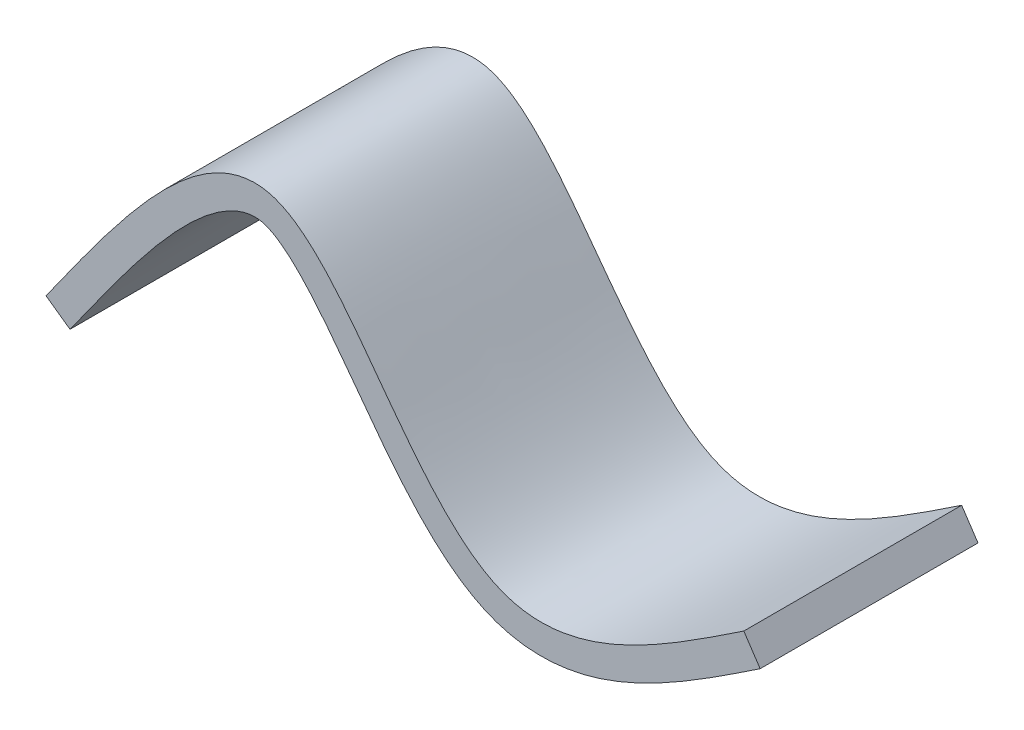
ISO-10303-21;
HEADER;
FILE_DESCRIPTION(('STEP AP214'),'2;1');
FILE_NAME('part.step','',(''),(''),'','','');
FILE_SCHEMA(('AUTOMOTIVE_DESIGN { 1 0 10303 214 1 1 1 1 }'));
ENDSEC;
DATA;
#1=APPLICATION_CONTEXT('core data for automotive mechanical design processes');
#2=APPLICATION_PROTOCOL_DEFINITION('international standard','automotive_design',2000,#1);
#3=PRODUCT_CONTEXT('',#1,'mechanical');
#4=PRODUCT('Part','Part','',(#3));
#5=PRODUCT_RELATED_PRODUCT_CATEGORY('part','',(#4));
#6=PRODUCT_DEFINITION_FORMATION('','',#4);
#7=PRODUCT_DEFINITION_CONTEXT('part definition',#1,'design');
#8=PRODUCT_DEFINITION('design','',#6,#7);
#9=PRODUCT_DEFINITION_SHAPE('','',#8);
#10=(LENGTH_UNIT() NAMED_UNIT(*) SI_UNIT(.MILLI.,.METRE.));
#11=(NAMED_UNIT(*) PLANE_ANGLE_UNIT() SI_UNIT($,.RADIAN.));
#12=(NAMED_UNIT(*) SI_UNIT($,.STERADIAN.) SOLID_ANGLE_UNIT());
#13=UNCERTAINTY_MEASURE_WITH_UNIT(LENGTH_MEASURE(1.E-05),#10,'distance_accuracy_value','');
#14=(GEOMETRIC_REPRESENTATION_CONTEXT(3) GLOBAL_UNCERTAINTY_ASSIGNED_CONTEXT((#13)) GLOBAL_UNIT_ASSIGNED_CONTEXT((#10,
#11,#12)) REPRESENTATION_CONTEXT('',''));
#15=CARTESIAN_POINT('',(0.,0.,0.));
#16=DIRECTION('',(0.,0.,1.));
#17=DIRECTION('',(1.,0.,0.));
#18=AXIS2_PLACEMENT_3D('',#15,#16,#17);
#19=CARTESIAN_POINT('',(-8.1111552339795,6.10642845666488,0.));
#20=DIRECTION('',(0.,0.,-1.));
#21=DIRECTION('',(-1.,0.,0.));
#22=AXIS2_PLACEMENT_3D('',#19,#20,#21);
#23=PLANE('',#22);
#24=DIRECTION('',(0.815720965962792,-0.578445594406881,0.));
#25=VECTOR('',#24,1.);
#26=CARTESIAN_POINT('',(-123.895256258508,-15.3748979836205,0.));
#27=LINE('',#26,#25);
#28=CARTESIAN_POINT('',(-123.895256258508,-15.3748979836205,0.));
#29=VERTEX_POINT('',#28);
#30=CARTESIAN_POINT('',(-115.738046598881,-21.1593539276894,0.));
#31=VERTEX_POINT('',#30);
#32=EDGE_CURVE('E11',#29,#31,#27,.T.);
#33=ORIENTED_EDGE('',*,*,#32,.F.);
#34=CARTESIAN_POINT('',(-123.895256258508,-15.3748979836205,0.));
#35=CARTESIAN_POINT('',(-97.4183903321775,21.9626405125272,0.));
#36=CARTESIAN_POINT('',(-42.5872049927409,99.2852926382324,0.));
#37=CARTESIAN_POINT('',(18.1572526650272,-58.8106771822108,0.));
#38=CARTESIAN_POINT('',(83.9371180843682,-14.948107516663,0.));
#39=CARTESIAN_POINT('',(113.139549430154,4.52432027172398,0.));
#40=B_SPLINE_CURVE_WITH_KNOTS('',3,(#34,#35,#36,#37,#38,#39),.UNSPECIFIED.,.F.,.F.,(4,1,1,4),
(0.,0.341775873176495,0.707786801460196,1.),.UNSPECIFIED.);
#41=CARTESIAN_POINT('',(113.139549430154,4.52432027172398,0.));
#42=VERTEX_POINT('',#41);
#43=EDGE_CURVE('E94',#29,#42,#40,.T.);
#44=ORIENTED_EDGE('',*,*,#43,.T.);
#45=DIRECTION('',(0.554781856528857,-0.83199584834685,0.));
#46=VECTOR('',#45,1.);
#47=CARTESIAN_POINT('',(113.139549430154,4.52432027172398,0.));
#48=LINE('',#47,#46);
#49=CARTESIAN_POINT('',(118.687367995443,-3.79563821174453,0.));
#50=VERTEX_POINT('',#49);
#51=EDGE_CURVE('E44',#42,#50,#48,.T.);
#52=ORIENTED_EDGE('',*,*,#51,.T.);
#53=CARTESIAN_POINT('',(-115.738046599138,-21.1593539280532,0.));
#54=CARTESIAN_POINT('',(-114.530320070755,-19.4562853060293,0.));
#55=CARTESIAN_POINT('',(-113.322640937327,-17.7531719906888,0.));
#56=CARTESIAN_POINT('',(-110.911941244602,-14.3612367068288,0.));
#57=CARTESIAN_POINT('',(-109.708945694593,-12.6723969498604,0.));
#58=CARTESIAN_POINT('',(-107.308320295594,-9.31757341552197,0.));
#59=CARTESIAN_POINT('',(-106.110766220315,-7.65153551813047,0.));
#60=CARTESIAN_POINT('',(-103.721801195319,-4.35103558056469,0.));
#61=CARTESIAN_POINT('',(-102.530545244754,-2.71646153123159,0.));
#62=CARTESIAN_POINT('',(-100.15509206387,0.512275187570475,0.));
#63=CARTESIAN_POINT('',(-98.9711598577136,2.10663248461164,0.));
#64=CARTESIAN_POINT('',(-96.6114222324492,5.2459608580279,0.));
#65=CARTESIAN_POINT('',(-95.4360265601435,6.79123930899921,0.));
#66=CARTESIAN_POINT('',(-93.0946261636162,9.82328592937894,0.));
#67=CARTESIAN_POINT('',(-91.9292153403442,11.3105116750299,0.));
#68=CARTESIAN_POINT('',(-89.6093010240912,14.2171640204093,0.));
#69=CARTESIAN_POINT('',(-88.4556209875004,15.6372461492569,0.));
#70=CARTESIAN_POINT('',(-86.1610155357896,18.4001471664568,0.));
#71=CARTESIAN_POINT('',(-85.0211957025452,19.7438814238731,0.));
#72=CARTESIAN_POINT('',(-82.7566003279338,22.3444378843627,0.));
#73=CARTESIAN_POINT('',(-81.6332731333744,23.6025169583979,0.));
#74=CARTESIAN_POINT('',(-79.4045340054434,26.0219645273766,0.));
#75=CARTESIAN_POINT('',(-78.3009827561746,27.1850390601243,0.));
#76=CARTESIAN_POINT('',(-76.115474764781,29.4045210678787,0.));
#77=CARTESIAN_POINT('',(-75.0358662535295,30.463231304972,0.));
#78=CARTESIAN_POINT('',(-72.9028719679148,32.4642374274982,0.));
#79=CARTESIAN_POINT('',(-71.8524057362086,33.4096152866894,0.));
#80=CARTESIAN_POINT('',(-70.2702133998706,34.759152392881,0.));
#81=CARTESIAN_POINT('',(-69.757416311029,35.1855415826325,0.));
#82=CARTESIAN_POINT('',(-68.7412308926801,36.0061294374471,0.));
#83=CARTESIAN_POINT('',(-68.2383302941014,36.4009301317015,0.));
#84=CARTESIAN_POINT('',(-67.2430121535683,37.157377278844,0.));
#85=CARTESIAN_POINT('',(-66.7511230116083,37.5197173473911,0.));
#86=CARTESIAN_POINT('',(-65.7789827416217,38.2103920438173,0.));
#87=CARTESIAN_POINT('',(-65.2992999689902,38.5395242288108,0.));
#88=CARTESIAN_POINT('',(-64.3528324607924,39.1631021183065,0.));
#89=CARTESIAN_POINT('',(-63.8866515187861,39.4584611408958,0.));
#90=CARTESIAN_POINT('',(-62.9685227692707,40.0140302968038,0.));
#91=CARTESIAN_POINT('',(-62.5172067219,40.2752804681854,0.));
#92=CARTESIAN_POINT('',(-61.6301711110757,40.762452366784,0.));
#93=CARTESIAN_POINT('',(-61.1950998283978,40.9895487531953,0.));
#94=CARTESIAN_POINT('',(-60.3418933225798,41.4085711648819,0.));
#95=CARTESIAN_POINT('',(-59.9244052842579,41.6018093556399,0.));
#96=CARTESIAN_POINT('',(-59.1075088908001,41.9537037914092,0.));
#97=CARTESIAN_POINT('',(-58.7087276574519,42.1138011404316,0.));
#98=CARTESIAN_POINT('',(-58.1145600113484,42.3325253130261,0.));
#99=CARTESIAN_POINT('',(-57.9224960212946,42.4002383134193,0.));
#100=CARTESIAN_POINT('',(-57.5432715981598,42.527632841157,0.));
#101=CARTESIAN_POINT('',(-57.3561784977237,42.5875139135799,0.));
#102=CARTESIAN_POINT('',(-56.9869320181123,42.6994483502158,0.));
#103=CARTESIAN_POINT('',(-56.8048402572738,42.7517046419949,0.));
#104=CARTESIAN_POINT('',(-56.4455810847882,42.8486168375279,0.));
#105=CARTESIAN_POINT('',(-56.2684689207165,42.8934769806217,0.));
#106=CARTESIAN_POINT('',(-55.9191042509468,42.9758437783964,0.));
#107=CARTESIAN_POINT('',(-55.7468997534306,43.0135534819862,0.));
#108=CARTESIAN_POINT('',(-55.4072275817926,43.0818802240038,0.));
#109=CARTESIAN_POINT('',(-55.2398000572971,43.1126961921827,0.));
#110=CARTESIAN_POINT('',(-54.9094957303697,43.1675029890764,0.));
#111=CARTESIAN_POINT('',(-54.7466508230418,43.1916852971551,0.));
#112=CARTESIAN_POINT('',(-54.4252577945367,43.2334902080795,0.));
#113=CARTESIAN_POINT('',(-54.2667332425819,43.2512931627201,0.));
#114=CARTESIAN_POINT('',(-53.9536565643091,43.2805925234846,0.));
#115=CARTESIAN_POINT('',(-53.799120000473,43.2922542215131,0.));
#116=CARTESIAN_POINT('',(-53.4936241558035,43.3095006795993,0.));
#117=CARTESIAN_POINT('',(-53.3426732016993,43.3152316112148,0.));
#118=CARTESIAN_POINT('',(-53.043884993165,43.3208107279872,0.));
#119=CARTESIAN_POINT('',(-52.8960500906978,43.3207819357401,0.));
#120=CARTESIAN_POINT('',(-52.6029672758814,43.3149884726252,0.));
#121=CARTESIAN_POINT('',(-52.4577174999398,43.3093198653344,0.));
#122=CARTESIAN_POINT('',(-52.1692234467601,43.292335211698,0.));
#123=CARTESIAN_POINT('',(-52.0259753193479,43.2810848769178,0.));
#124=CARTESIAN_POINT('',(-51.740859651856,43.2529567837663,0.));
#125=CARTESIAN_POINT('',(-51.5989889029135,43.2361116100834,0.));
#126=CARTESIAN_POINT('',(-51.3159731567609,43.1967389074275,0.));
#127=CARTESIAN_POINT('',(-51.1748285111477,43.1742088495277,0.));
#128=CARTESIAN_POINT('',(-50.8925970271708,43.1233279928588,0.));
#129=CARTESIAN_POINT('',(-50.7515171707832,43.0949384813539,0.));
#130=CARTESIAN_POINT('',(-50.4687466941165,43.0321295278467,0.));
#131=CARTESIAN_POINT('',(-50.3270727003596,42.9976352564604,0.));
#132=CARTESIAN_POINT('',(-50.0419559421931,42.9221468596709,0.));
#133=CARTESIAN_POINT('',(-49.8985481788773,42.8810207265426,0.));
#134=CARTESIAN_POINT('',(-49.6064083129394,42.7911140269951,0.));
#135=CARTESIAN_POINT('',(-49.4577618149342,42.7420562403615,0.));
#136=CARTESIAN_POINT('',(-49.15443910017,42.6357586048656,0.));
#137=CARTESIAN_POINT('',(-48.9998676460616,42.5782208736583,0.));
#138=CARTESIAN_POINT('',(-48.684634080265,42.4545418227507,0.));
#139=CARTESIAN_POINT('',(-48.5240882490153,42.3881049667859,0.));
#140=CARTESIAN_POINT('',(-48.1969392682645,42.2462660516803,0.));
#141=CARTESIAN_POINT('',(-48.0304611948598,42.1705763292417,0.));
#142=CARTESIAN_POINT('',(-47.6915595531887,42.0099217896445,0.));
#143=CARTESIAN_POINT('',(-47.5192672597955,41.9246806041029,0.));
#144=CARTESIAN_POINT('',(-47.1689181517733,41.7446719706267,0.));
#145=CARTESIAN_POINT('',(-46.9909967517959,41.6496419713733,0.));
#146=CARTESIAN_POINT('',(-46.43635503,41.3430613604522,0.));
#147=CARTESIAN_POINT('',(-46.0646587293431,41.1223855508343,0.));
#148=CARTESIAN_POINT('',(-45.3007068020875,40.6423061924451,0.));
#149=CARTESIAN_POINT('',(-44.909530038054,40.3812035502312,0.));
#150=CARTESIAN_POINT('',(-44.1088617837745,39.8200914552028,0.));
#151=CARTESIAN_POINT('',(-43.700386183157,39.5186391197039,0.));
#152=CARTESIAN_POINT('',(-42.8673758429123,38.8773495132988,0.));
#153=CARTESIAN_POINT('',(-42.4437730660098,38.5363079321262,0.));
#154=CARTESIAN_POINT('',(-41.5825836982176,37.8168573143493,0.));
#155=CARTESIAN_POINT('',(-41.1458321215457,37.4374528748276,0.));
#156=CARTESIAN_POINT('',(-40.2601830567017,36.642675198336,0.));
#157=CARTESIAN_POINT('',(-39.8120203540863,36.2264860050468,0.));
#158=CARTESIAN_POINT('',(-38.9051627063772,35.3597796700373,0.));
#159=CARTESIAN_POINT('',(-38.4471065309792,34.9085967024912,0.));
#160=CARTESIAN_POINT('',(-37.0290986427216,33.4761951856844,0.));
#161=CARTESIAN_POINT('',(-36.0896514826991,32.4746817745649,0.));
#162=CARTESIAN_POINT('',(-34.1801352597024,30.3595280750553,0.));
#163=CARTESIAN_POINT('',(-33.2131445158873,29.2431435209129,0.));
#164=CARTESIAN_POINT('',(-31.2542530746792,26.9139291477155,0.));
#165=CARTESIAN_POINT('',(-30.2644233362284,25.6993669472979,0.));
#166=CARTESIAN_POINT('',(-28.2633561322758,23.1899119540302,0.));
#167=CARTESIAN_POINT('',(-27.2534217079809,21.8939866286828,0.));
#168=CARTESIAN_POINT('',(-25.2139591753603,19.2377680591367,0.));
#169=CARTESIAN_POINT('',(-24.1851662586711,17.8769130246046,0.));
#170=CARTESIAN_POINT('',(-22.108526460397,15.1065719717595,0.));
#171=CARTESIAN_POINT('',(-21.061013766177,13.6968363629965,0.));
#172=CARTESIAN_POINT('',(-18.9464717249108,10.8442138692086,0.));
#173=CARTESIAN_POINT('',(-17.8795146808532,9.40127419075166,0.));
#174=CARTESIAN_POINT('',(-14.6296327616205,5.02144628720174,0.));
#175=CARTESIAN_POINT('',(-12.4390424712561,2.09006011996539,0.));
#176=CARTESIAN_POINT('',(-9.07929276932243,-2.26914300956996,0.));
#177=CARTESIAN_POINT('',(-7.94235575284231,-3.72164550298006,0.));
#178=CARTESIAN_POINT('',(-5.63880670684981,-6.60082662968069,0.));
#179=CARTESIAN_POINT('',(-4.47222304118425,-8.02752786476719,0.));
#180=CARTESIAN_POINT('',(-2.10457596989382,-10.8408911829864,0.));
#181=CARTESIAN_POINT('',(-0.903698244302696,-12.2277086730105,0.));
#182=CARTESIAN_POINT('',(1.53851719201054,-14.946996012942,0.));
#183=CARTESIAN_POINT('',(2.77949049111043,-16.2797916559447,0.));
#184=CARTESIAN_POINT('',(5.30946727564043,-18.8765718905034,0.));
#185=CARTESIAN_POINT('',(6.59794582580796,-20.1410627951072,0.));
#186=CARTESIAN_POINT('',(8.5775540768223,-21.978261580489,0.));
#187=CARTESIAN_POINT('',(9.24291241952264,-22.5788084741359,0.));
#188=CARTESIAN_POINT('',(10.5890595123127,-23.7567046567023,0.));
#189=CARTESIAN_POINT('',(11.2697730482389,-24.3341396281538,0.));
#190=CARTESIAN_POINT('',(12.647982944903,-25.4635791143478,0.));
#191=CARTESIAN_POINT('',(13.3454111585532,-26.0156666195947,0.));
#192=CARTESIAN_POINT('',(14.7585034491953,-27.0919898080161,0.));
#193=CARTESIAN_POINT('',(15.4741129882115,-27.6162969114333,0.));
#194=CARTESIAN_POINT('',(16.9250491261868,-28.6343862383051,0.));
#195=CARTESIAN_POINT('',(17.6603418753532,-29.1282165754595,0.));
#196=CARTESIAN_POINT('',(19.1520963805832,-30.0823810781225,0.));
#197=CARTESIAN_POINT('',(19.9085516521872,-30.5427253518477,0.));
#198=CARTESIAN_POINT('',(21.4439693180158,-31.426569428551,0.));
#199=CARTESIAN_POINT('',(22.2229577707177,-31.8500240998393,0.));
#200=CARTESIAN_POINT('',(23.8044980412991,-32.656427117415,0.));
#201=CARTESIAN_POINT('',(24.6071106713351,-33.0392566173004,0.));
#202=CARTESIAN_POINT('',(26.235622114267,-33.7595952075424,0.));
#203=CARTESIAN_POINT('',(27.0615882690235,-34.0969525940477,0.));
#204=CARTESIAN_POINT('',(28.7264819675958,-34.7194251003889,0.));
#205=CARTESIAN_POINT('',(29.5652803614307,-35.0048853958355,0.));
#206=CARTESIAN_POINT('',(31.2509853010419,-35.5234261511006,0.));
#207=CARTESIAN_POINT('',(32.097759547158,-35.7569370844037,0.));
#208=CARTESIAN_POINT('',(33.7969808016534,-36.1726583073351,0.));
#209=CARTESIAN_POINT('',(34.6493358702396,-36.3552447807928,0.));
#210=CARTESIAN_POINT('',(36.3574002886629,-36.6706920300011,0.));
#211=CARTESIAN_POINT('',(37.2130510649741,-36.8038707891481,0.));
#212=CARTESIAN_POINT('',(38.9256556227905,-37.0223915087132,0.));
#213=CARTESIAN_POINT('',(39.7825766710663,-37.1079911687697,0.));
#214=CARTESIAN_POINT('',(41.4959881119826,-37.2335058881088,0.));
#215=CARTESIAN_POINT('',(42.3524642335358,-37.2736176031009,0.));
#216=CARTESIAN_POINT('',(44.0636032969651,-37.3104730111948,0.));
#217=CARTESIAN_POINT('',(44.9182633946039,-37.3073536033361,0.));
#218=CARTESIAN_POINT('',(46.624736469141,-37.2601431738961,0.));
#219=CARTESIAN_POINT('',(47.4765517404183,-37.216132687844,0.));
#220=CARTESIAN_POINT('',(49.1766241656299,-37.0895410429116,0.));
#221=CARTESIAN_POINT('',(50.0248835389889,-37.0069893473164,0.));
#222=CARTESIAN_POINT('',(51.7174143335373,-36.8056628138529,0.));
#223=CARTESIAN_POINT('',(52.5616839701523,-36.6868730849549,0.));
#224=CARTESIAN_POINT('',(54.2460368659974,-36.4153241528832,0.));
#225=CARTESIAN_POINT('',(55.0861117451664,-36.2625132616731,0.));
#226=CARTESIAN_POINT('',(56.7620578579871,-35.9250575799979,0.));
#227=CARTESIAN_POINT('',(57.5979127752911,-35.7403321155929,0.));
#228=CARTESIAN_POINT('',(59.2655326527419,-35.3410542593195,0.));
#229=CARTESIAN_POINT('',(60.0972730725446,-35.1263997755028,0.));
#230=CARTESIAN_POINT('',(61.7568761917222,-34.6691407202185,0.));
#231=CARTESIAN_POINT('',(62.5847066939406,-34.4264195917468,0.));
#232=CARTESIAN_POINT('',(64.2367307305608,-33.9147836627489,0.));
#233=CARTESIAN_POINT('',(65.0608853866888,-33.6457439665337,0.));
#234=CARTESIAN_POINT('',(67.5355244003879,-32.7993673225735,0.));
#235=CARTESIAN_POINT('',(69.1740138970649,-32.186745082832,0.));
#236=CARTESIAN_POINT('',(72.4399405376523,-30.8759811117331,0.));
#237=CARTESIAN_POINT('',(74.0669807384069,-30.1768623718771,0.));
#238=CARTESIAN_POINT('',(77.3122915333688,-28.7038022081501,0.));
#239=CARTESIAN_POINT('',(78.9301713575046,-27.9290042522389,0.));
#240=CARTESIAN_POINT('',(82.1587664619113,-26.3145282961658,0.));
#241=CARTESIAN_POINT('',(83.7691306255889,-25.4741520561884,0.));
#242=CARTESIAN_POINT('',(86.9837673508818,-23.7378395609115,0.));
#243=CARTESIAN_POINT('',(88.5877506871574,-22.8413703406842,0.));
#244=CARTESIAN_POINT('',(93.4124256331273,-20.0705308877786,0.));
#245=CARTESIAN_POINT('',(96.5998309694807,-18.1383548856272,0.));
#246=CARTESIAN_POINT('',(102.952126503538,-14.1608451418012,0.));
#247=CARTESIAN_POINT('',(106.116362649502,-12.1144848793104,0.));
#248=CARTESIAN_POINT('',(110.843429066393,-9.01016038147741,0.));
#249=CARTESIAN_POINT('',(112.417187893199,-7.96871848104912,0.));
#250=CARTESIAN_POINT('',(115.556416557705,-5.88338570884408,0.));
#251=CARTESIAN_POINT('',(117.121897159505,-4.83951106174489,0.));
#252=CARTESIAN_POINT('',(118.687367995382,-3.79563821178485,0.));
#253=B_SPLINE_CURVE_WITH_KNOTS('',3,(#53,#54,#55,#56,#57,#58,#59,#60,#61,#62,#63,#64,#65,#66,
#67,#68,#69,#70,#71,#72,#73,#74,#75,#76,#77,#78,#79,#80,#81,#82,#83,#84,#85,#86,#87,#88,#89,#90,
#91,#92,#93,#94,#95,#96,#97,#98,#99,#100,#101,#102,#103,#104,#105,#106,#107,#108,#109,#110,#111,
#112,#113,#114,#115,#116,#117,#118,#119,#120,#121,#122,#123,#124,#125,#126,#127,#128,#129,#130,
#131,#132,#133,#134,#135,#136,#137,#138,#139,#140,#141,#142,#143,#144,#145,#146,#147,#148,#149,
#150,#151,#152,#153,#154,#155,#156,#157,#158,#159,#160,#161,#162,#163,#164,#165,#166,#167,#168,
#169,#170,#171,#172,#173,#174,#175,#176,#177,#178,#179,#180,#181,#182,#183,#184,#185,#186,#187,
#188,#189,#190,#191,#192,#193,#194,#195,#196,#197,#198,#199,#200,#201,#202,#203,#204,#205,#206,
#207,#208,#209,#210,#211,#212,#213,#214,#215,#216,#217,#218,#219,#220,#221,#222,#223,#224,#225,
#226,#227,#228,#229,#230,#231,#232,#233,#234,#235,#236,#237,#238,#239,#240,#241,#242,#243,#244,
#245,#246,#247,#248,#249,#250,#251,#252),.UNSPECIFIED.,.F.,.F.,(4,2,2,2,2,2,2,2,2,2,2,2,2,2,2,2,
2,2,2,2,2,2,2,2,2,2,2,2,2,2,2,2,2,2,2,2,2,2,2,2,2,2,2,2,2,2,2,2,2,2,2,2,2,2,2,2,2,2,2,2,2,2,2,2,
2,2,2,2,2,2,2,2,2,2,2,2,2,2,2,2,2,2,2,2,2,2,2,2,2,2,2,2,2,2,2,2,2,2,2,4),(0.,6.26351388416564,
12.4839895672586,18.639312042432,24.7070619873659,30.664562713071,36.4889159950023,
42.1570287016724,47.6456325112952,52.9313005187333,57.9904683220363,62.7994755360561,
67.3346611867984,71.572581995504,73.573091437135,75.4908803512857,77.3233821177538,
79.0682507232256,80.7234594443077,82.2874360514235,83.7592443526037,85.1388217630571,
86.4272799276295,87.0381587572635,87.6273962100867,88.1956316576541,88.7436535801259,
89.2724125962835,89.7830332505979,90.2768238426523,90.7552834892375,91.2201056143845,
91.6731770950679,92.1165724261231,92.5525424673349,92.9834976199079,93.4119856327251,
93.840664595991,94.2722720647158,94.7095915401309,95.1570369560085,95.6265182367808,
96.1212063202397,96.6423464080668,97.1908743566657,97.7674509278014,98.3724963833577,
99.6685436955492,101.078921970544,102.601411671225,104.23246989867,105.967708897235,
107.802228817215,109.730841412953,113.848703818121,118.278764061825,122.978690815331,
127.90738039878,133.025193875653,138.294102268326,143.677862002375,154.655458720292,
160.188817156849,165.71706739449,171.219596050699,176.681477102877,182.094812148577,
184.783372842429,187.460812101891,190.128747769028,192.789453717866,195.445845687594,
198.101432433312,200.760223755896,203.426590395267,206.101643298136,208.75819529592,
211.391838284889,214.005477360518,216.601990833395,219.184300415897,221.755402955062,
224.318365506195,226.876290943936,229.432264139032,231.989289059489,234.550225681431,
237.117733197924,239.694223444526,242.281826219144,244.882366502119,250.127527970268,
255.438533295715,260.818768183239,266.267240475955,271.779149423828,282.957951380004,
294.262200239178,299.923632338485,305.568404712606),.UNSPECIFIED.);
#254=EDGE_CURVE('E108',#31,#50,#253,.T.);
#255=ORIENTED_EDGE('',*,*,#254,.F.);
#256=EDGE_LOOP('',(#33,#44,#52,#255));
#257=FACE_BOUND('',#256,.T.);
#258=ADVANCED_FACE('F34',(#257),#23,.T.);
#259=CARTESIAN_POINT('',(113.139549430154,4.52432027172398,0.));
#260=DIRECTION('',(0.83199584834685,0.554781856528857,0.));
#261=DIRECTION('',(0.,0.,1.));
#262=AXIS2_PLACEMENT_3D('',#259,#260,#261);
#263=PLANE('',#262);
#264=ORIENTED_EDGE('',*,*,#51,.F.);
#265=DIRECTION('',(0.,0.,1.));
#266=VECTOR('',#265,1.);
#267=CARTESIAN_POINT('',(113.139549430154,4.52432027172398,0.));
#268=LINE('',#267,#266);
#269=CARTESIAN_POINT('',(113.139549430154,4.52432027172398,74.));
#270=VERTEX_POINT('',#269);
#271=EDGE_CURVE('E90',#42,#270,#268,.T.);
#272=ORIENTED_EDGE('',*,*,#271,.T.);
#273=DIRECTION('',(0.554781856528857,-0.83199584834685,0.));
#274=VECTOR('',#273,1.);
#275=CARTESIAN_POINT('',(113.139549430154,4.52432027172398,74.));
#276=LINE('',#275,#274);
#277=CARTESIAN_POINT('',(118.687367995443,-3.79563821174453,74.));
#278=VERTEX_POINT('',#277);
#279=EDGE_CURVE('E75',#270,#278,#276,.T.);
#280=ORIENTED_EDGE('',*,*,#279,.T.);
#281=DIRECTION('',(0.,0.,1.));
#282=VECTOR('',#281,1.);
#283=CARTESIAN_POINT('',(118.687367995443,-3.79563821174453,0.));
#284=LINE('',#283,#282);
#285=EDGE_CURVE('E112',#50,#278,#284,.T.);
#286=ORIENTED_EDGE('',*,*,#285,.F.);
#287=EDGE_LOOP('',(#264,#272,#280,#286));
#288=FACE_BOUND('',#287,.T.);
#289=ADVANCED_FACE('F93',(#288),#263,.T.);
#290=CARTESIAN_POINT('',(-8.1111552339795,6.10642845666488,74.));
#291=DIRECTION('',(0.,0.,-1.));
#292=DIRECTION('',(-1.,0.,0.));
#293=AXIS2_PLACEMENT_3D('',#290,#291,#292);
#294=PLANE('',#293);
#295=ORIENTED_EDGE('',*,*,#279,.F.);
#296=CARTESIAN_POINT('',(-123.895256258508,-15.3748979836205,74.));
#297=CARTESIAN_POINT('',(-97.4183903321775,21.9626405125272,74.));
#298=CARTESIAN_POINT('',(-42.5872049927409,99.2852926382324,74.));
#299=CARTESIAN_POINT('',(18.1572526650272,-58.8106771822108,74.));
#300=CARTESIAN_POINT('',(83.9371180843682,-14.948107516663,74.));
#301=CARTESIAN_POINT('',(113.139549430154,4.52432027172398,74.));
#302=B_SPLINE_CURVE_WITH_KNOTS('',3,(#296,#297,#298,#299,#300,#301),.UNSPECIFIED.,.F.,.F.,(4,1,
1,4),(0.,0.341775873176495,0.707786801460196,1.),.UNSPECIFIED.);
#303=CARTESIAN_POINT('',(-123.895256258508,-15.3748979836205,74.));
#304=VERTEX_POINT('',#303);
#305=EDGE_CURVE('E78',#304,#270,#302,.T.);
#306=ORIENTED_EDGE('',*,*,#305,.F.);
#307=DIRECTION('',(0.815720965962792,-0.578445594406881,0.));
#308=VECTOR('',#307,1.);
#309=CARTESIAN_POINT('',(-123.895256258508,-15.3748979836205,74.));
#310=LINE('',#309,#308);
#311=CARTESIAN_POINT('',(-115.738046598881,-21.1593539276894,74.));
#312=VERTEX_POINT('',#311);
#313=EDGE_CURVE('E38',#304,#312,#310,.T.);
#314=ORIENTED_EDGE('',*,*,#313,.T.);
#315=CARTESIAN_POINT('',(-115.738046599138,-21.1593539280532,74.));
#316=CARTESIAN_POINT('',(-114.530320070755,-19.4562853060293,74.));
#317=CARTESIAN_POINT('',(-113.322640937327,-17.7531719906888,74.));
#318=CARTESIAN_POINT('',(-110.911941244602,-14.3612367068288,74.));
#319=CARTESIAN_POINT('',(-109.708945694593,-12.6723969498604,74.));
#320=CARTESIAN_POINT('',(-107.308320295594,-9.31757341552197,74.));
#321=CARTESIAN_POINT('',(-106.110766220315,-7.65153551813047,74.));
#322=CARTESIAN_POINT('',(-103.721801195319,-4.35103558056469,74.));
#323=CARTESIAN_POINT('',(-102.530545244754,-2.71646153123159,74.));
#324=CARTESIAN_POINT('',(-100.15509206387,0.512275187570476,74.));
#325=CARTESIAN_POINT('',(-98.9711598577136,2.10663248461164,74.));
#326=CARTESIAN_POINT('',(-96.6114222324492,5.2459608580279,74.));
#327=CARTESIAN_POINT('',(-95.4360265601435,6.79123930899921,74.));
#328=CARTESIAN_POINT('',(-93.0946261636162,9.82328592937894,74.));
#329=CARTESIAN_POINT('',(-91.9292153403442,11.3105116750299,74.));
#330=CARTESIAN_POINT('',(-89.6093010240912,14.2171640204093,74.));
#331=CARTESIAN_POINT('',(-88.4556209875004,15.6372461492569,74.));
#332=CARTESIAN_POINT('',(-86.1610155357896,18.4001471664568,74.));
#333=CARTESIAN_POINT('',(-85.0211957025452,19.7438814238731,74.));
#334=CARTESIAN_POINT('',(-82.7566003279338,22.3444378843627,74.));
#335=CARTESIAN_POINT('',(-81.6332731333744,23.6025169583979,74.));
#336=CARTESIAN_POINT('',(-79.4045340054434,26.0219645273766,74.));
#337=CARTESIAN_POINT('',(-78.3009827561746,27.1850390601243,74.));
#338=CARTESIAN_POINT('',(-76.115474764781,29.4045210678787,74.));
#339=CARTESIAN_POINT('',(-75.0358662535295,30.463231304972,74.));
#340=CARTESIAN_POINT('',(-72.9028719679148,32.4642374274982,74.));
#341=CARTESIAN_POINT('',(-71.8524057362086,33.4096152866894,74.));
#342=CARTESIAN_POINT('',(-70.2702133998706,34.759152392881,74.));
#343=CARTESIAN_POINT('',(-69.757416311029,35.1855415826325,74.));
#344=CARTESIAN_POINT('',(-68.7412308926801,36.0061294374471,74.));
#345=CARTESIAN_POINT('',(-68.2383302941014,36.4009301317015,74.));
#346=CARTESIAN_POINT('',(-67.2430121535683,37.157377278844,74.));
#347=CARTESIAN_POINT('',(-66.7511230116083,37.5197173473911,74.));
#348=CARTESIAN_POINT('',(-65.7789827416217,38.2103920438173,74.));
#349=CARTESIAN_POINT('',(-65.2992999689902,38.5395242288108,74.));
#350=CARTESIAN_POINT('',(-64.3528324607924,39.1631021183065,74.));
#351=CARTESIAN_POINT('',(-63.8866515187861,39.4584611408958,74.));
#352=CARTESIAN_POINT('',(-62.9685227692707,40.0140302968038,74.));
#353=CARTESIAN_POINT('',(-62.5172067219,40.2752804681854,74.));
#354=CARTESIAN_POINT('',(-61.6301711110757,40.762452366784,74.));
#355=CARTESIAN_POINT('',(-61.1950998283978,40.9895487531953,74.));
#356=CARTESIAN_POINT('',(-60.3418933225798,41.4085711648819,74.));
#357=CARTESIAN_POINT('',(-59.9244052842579,41.6018093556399,74.));
#358=CARTESIAN_POINT('',(-59.1075088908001,41.9537037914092,74.));
#359=CARTESIAN_POINT('',(-58.7087276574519,42.1138011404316,74.));
#360=CARTESIAN_POINT('',(-58.1145600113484,42.3325253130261,74.));
#361=CARTESIAN_POINT('',(-57.9224960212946,42.4002383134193,74.));
#362=CARTESIAN_POINT('',(-57.5432715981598,42.527632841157,74.));
#363=CARTESIAN_POINT('',(-57.3561784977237,42.5875139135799,74.));
#364=CARTESIAN_POINT('',(-56.9869320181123,42.6994483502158,74.));
#365=CARTESIAN_POINT('',(-56.8048402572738,42.7517046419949,74.));
#366=CARTESIAN_POINT('',(-56.4455810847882,42.8486168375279,74.));
#367=CARTESIAN_POINT('',(-56.2684689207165,42.8934769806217,74.));
#368=CARTESIAN_POINT('',(-55.9191042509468,42.9758437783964,74.));
#369=CARTESIAN_POINT('',(-55.7468997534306,43.0135534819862,74.));
#370=CARTESIAN_POINT('',(-55.4072275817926,43.0818802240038,74.));
#371=CARTESIAN_POINT('',(-55.2398000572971,43.1126961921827,74.));
#372=CARTESIAN_POINT('',(-54.9094957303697,43.1675029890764,74.));
#373=CARTESIAN_POINT('',(-54.7466508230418,43.1916852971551,74.));
#374=CARTESIAN_POINT('',(-54.4252577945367,43.2334902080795,74.));
#375=CARTESIAN_POINT('',(-54.2667332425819,43.2512931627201,74.));
#376=CARTESIAN_POINT('',(-53.9536565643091,43.2805925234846,74.));
#377=CARTESIAN_POINT('',(-53.799120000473,43.2922542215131,74.));
#378=CARTESIAN_POINT('',(-53.4936241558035,43.3095006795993,74.));
#379=CARTESIAN_POINT('',(-53.3426732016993,43.3152316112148,74.));
#380=CARTESIAN_POINT('',(-53.043884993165,43.3208107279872,74.));
#381=CARTESIAN_POINT('',(-52.8960500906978,43.3207819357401,74.));
#382=CARTESIAN_POINT('',(-52.6029672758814,43.3149884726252,74.));
#383=CARTESIAN_POINT('',(-52.4577174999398,43.3093198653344,74.));
#384=CARTESIAN_POINT('',(-52.1692234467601,43.292335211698,74.));
#385=CARTESIAN_POINT('',(-52.0259753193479,43.2810848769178,74.));
#386=CARTESIAN_POINT('',(-51.740859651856,43.2529567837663,74.));
#387=CARTESIAN_POINT('',(-51.5989889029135,43.2361116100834,74.));
#388=CARTESIAN_POINT('',(-51.3159731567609,43.1967389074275,74.));
#389=CARTESIAN_POINT('',(-51.1748285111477,43.1742088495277,74.));
#390=CARTESIAN_POINT('',(-50.8925970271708,43.1233279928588,74.));
#391=CARTESIAN_POINT('',(-50.7515171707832,43.0949384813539,74.));
#392=CARTESIAN_POINT('',(-50.4687466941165,43.0321295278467,74.));
#393=CARTESIAN_POINT('',(-50.3270727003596,42.9976352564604,74.));
#394=CARTESIAN_POINT('',(-50.0419559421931,42.9221468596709,74.));
#395=CARTESIAN_POINT('',(-49.8985481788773,42.8810207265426,74.));
#396=CARTESIAN_POINT('',(-49.6064083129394,42.7911140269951,74.));
#397=CARTESIAN_POINT('',(-49.4577618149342,42.7420562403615,74.));
#398=CARTESIAN_POINT('',(-49.15443910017,42.6357586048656,74.));
#399=CARTESIAN_POINT('',(-48.9998676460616,42.5782208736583,74.));
#400=CARTESIAN_POINT('',(-48.684634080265,42.4545418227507,74.));
#401=CARTESIAN_POINT('',(-48.5240882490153,42.3881049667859,74.));
#402=CARTESIAN_POINT('',(-48.1969392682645,42.2462660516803,74.));
#403=CARTESIAN_POINT('',(-48.0304611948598,42.1705763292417,74.));
#404=CARTESIAN_POINT('',(-47.6915595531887,42.0099217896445,74.));
#405=CARTESIAN_POINT('',(-47.5192672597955,41.9246806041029,74.));
#406=CARTESIAN_POINT('',(-47.1689181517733,41.7446719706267,74.));
#407=CARTESIAN_POINT('',(-46.9909967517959,41.6496419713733,74.));
#408=CARTESIAN_POINT('',(-46.43635503,41.3430613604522,74.));
#409=CARTESIAN_POINT('',(-46.0646587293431,41.1223855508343,74.));
#410=CARTESIAN_POINT('',(-45.3007068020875,40.6423061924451,74.));
#411=CARTESIAN_POINT('',(-44.909530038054,40.3812035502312,74.));
#412=CARTESIAN_POINT('',(-44.1088617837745,39.8200914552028,74.));
#413=CARTESIAN_POINT('',(-43.700386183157,39.5186391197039,74.));
#414=CARTESIAN_POINT('',(-42.8673758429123,38.8773495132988,74.));
#415=CARTESIAN_POINT('',(-42.4437730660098,38.5363079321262,74.));
#416=CARTESIAN_POINT('',(-41.5825836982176,37.8168573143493,74.));
#417=CARTESIAN_POINT('',(-41.1458321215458,37.4374528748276,74.));
#418=CARTESIAN_POINT('',(-40.2601830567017,36.642675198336,74.));
#419=CARTESIAN_POINT('',(-39.8120203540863,36.2264860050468,74.));
#420=CARTESIAN_POINT('',(-38.9051627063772,35.3597796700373,74.));
#421=CARTESIAN_POINT('',(-38.4471065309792,34.9085967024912,74.));
#422=CARTESIAN_POINT('',(-37.0290986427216,33.4761951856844,74.));
#423=CARTESIAN_POINT('',(-36.0896514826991,32.4746817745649,74.));
#424=CARTESIAN_POINT('',(-34.1801352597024,30.3595280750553,74.));
#425=CARTESIAN_POINT('',(-33.2131445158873,29.2431435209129,74.));
#426=CARTESIAN_POINT('',(-31.2542530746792,26.9139291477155,74.));
#427=CARTESIAN_POINT('',(-30.2644233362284,25.6993669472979,74.));
#428=CARTESIAN_POINT('',(-28.2633561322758,23.1899119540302,74.));
#429=CARTESIAN_POINT('',(-27.2534217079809,21.8939866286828,74.));
#430=CARTESIAN_POINT('',(-25.2139591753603,19.2377680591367,74.));
#431=CARTESIAN_POINT('',(-24.1851662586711,17.8769130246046,74.));
#432=CARTESIAN_POINT('',(-22.108526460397,15.1065719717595,74.));
#433=CARTESIAN_POINT('',(-21.061013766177,13.6968363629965,74.));
#434=CARTESIAN_POINT('',(-18.9464717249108,10.8442138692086,74.));
#435=CARTESIAN_POINT('',(-17.8795146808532,9.40127419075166,74.));
#436=CARTESIAN_POINT('',(-14.6296327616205,5.02144628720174,74.));
#437=CARTESIAN_POINT('',(-12.4390424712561,2.09006011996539,74.));
#438=CARTESIAN_POINT('',(-9.07929276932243,-2.26914300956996,74.));
#439=CARTESIAN_POINT('',(-7.94235575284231,-3.72164550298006,74.));
#440=CARTESIAN_POINT('',(-5.63880670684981,-6.60082662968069,74.));
#441=CARTESIAN_POINT('',(-4.47222304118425,-8.02752786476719,74.));
#442=CARTESIAN_POINT('',(-2.10457596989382,-10.8408911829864,74.));
#443=CARTESIAN_POINT('',(-0.903698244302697,-12.2277086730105,74.));
#444=CARTESIAN_POINT('',(1.53851719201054,-14.946996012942,74.));
#445=CARTESIAN_POINT('',(2.77949049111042,-16.2797916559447,74.));
#446=CARTESIAN_POINT('',(5.30946727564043,-18.8765718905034,74.));
#447=CARTESIAN_POINT('',(6.59794582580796,-20.1410627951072,74.));
#448=CARTESIAN_POINT('',(8.5775540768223,-21.978261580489,74.));
#449=CARTESIAN_POINT('',(9.24291241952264,-22.5788084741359,74.));
#450=CARTESIAN_POINT('',(10.5890595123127,-23.7567046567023,74.));
#451=CARTESIAN_POINT('',(11.2697730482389,-24.3341396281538,74.));
#452=CARTESIAN_POINT('',(12.647982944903,-25.4635791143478,74.));
#453=CARTESIAN_POINT('',(13.3454111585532,-26.0156666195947,74.));
#454=CARTESIAN_POINT('',(14.7585034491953,-27.0919898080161,74.));
#455=CARTESIAN_POINT('',(15.4741129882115,-27.6162969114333,74.));
#456=CARTESIAN_POINT('',(16.9250491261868,-28.6343862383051,74.));
#457=CARTESIAN_POINT('',(17.6603418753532,-29.1282165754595,74.));
#458=CARTESIAN_POINT('',(19.1520963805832,-30.0823810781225,74.));
#459=CARTESIAN_POINT('',(19.9085516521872,-30.5427253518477,74.));
#460=CARTESIAN_POINT('',(21.4439693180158,-31.426569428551,74.));
#461=CARTESIAN_POINT('',(22.2229577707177,-31.8500240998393,74.));
#462=CARTESIAN_POINT('',(23.8044980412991,-32.656427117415,74.));
#463=CARTESIAN_POINT('',(24.6071106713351,-33.0392566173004,74.));
#464=CARTESIAN_POINT('',(26.235622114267,-33.7595952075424,74.));
#465=CARTESIAN_POINT('',(27.0615882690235,-34.0969525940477,74.));
#466=CARTESIAN_POINT('',(28.7264819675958,-34.7194251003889,74.));
#467=CARTESIAN_POINT('',(29.5652803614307,-35.0048853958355,74.));
#468=CARTESIAN_POINT('',(31.2509853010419,-35.5234261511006,74.));
#469=CARTESIAN_POINT('',(32.097759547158,-35.7569370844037,74.));
#470=CARTESIAN_POINT('',(33.7969808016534,-36.1726583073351,74.));
#471=CARTESIAN_POINT('',(34.6493358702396,-36.3552447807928,74.));
#472=CARTESIAN_POINT('',(36.3574002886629,-36.6706920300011,74.));
#473=CARTESIAN_POINT('',(37.2130510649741,-36.8038707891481,74.));
#474=CARTESIAN_POINT('',(38.9256556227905,-37.0223915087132,74.));
#475=CARTESIAN_POINT('',(39.7825766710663,-37.1079911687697,74.));
#476=CARTESIAN_POINT('',(41.4959881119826,-37.2335058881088,74.));
#477=CARTESIAN_POINT('',(42.3524642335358,-37.2736176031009,74.));
#478=CARTESIAN_POINT('',(44.0636032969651,-37.3104730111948,74.));
#479=CARTESIAN_POINT('',(44.9182633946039,-37.3073536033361,74.));
#480=CARTESIAN_POINT('',(46.624736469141,-37.2601431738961,74.));
#481=CARTESIAN_POINT('',(47.4765517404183,-37.216132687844,74.));
#482=CARTESIAN_POINT('',(49.1766241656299,-37.0895410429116,74.));
#483=CARTESIAN_POINT('',(50.0248835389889,-37.0069893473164,74.));
#484=CARTESIAN_POINT('',(51.7174143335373,-36.8056628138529,74.));
#485=CARTESIAN_POINT('',(52.5616839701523,-36.6868730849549,74.));
#486=CARTESIAN_POINT('',(54.2460368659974,-36.4153241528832,74.));
#487=CARTESIAN_POINT('',(55.0861117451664,-36.2625132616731,74.));
#488=CARTESIAN_POINT('',(56.7620578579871,-35.925057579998,74.));
#489=CARTESIAN_POINT('',(57.5979127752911,-35.7403321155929,74.));
#490=CARTESIAN_POINT('',(59.2655326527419,-35.3410542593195,74.));
#491=CARTESIAN_POINT('',(60.0972730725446,-35.1263997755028,74.));
#492=CARTESIAN_POINT('',(61.7568761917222,-34.6691407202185,74.));
#493=CARTESIAN_POINT('',(62.5847066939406,-34.4264195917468,74.));
#494=CARTESIAN_POINT('',(64.2367307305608,-33.9147836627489,74.));
#495=CARTESIAN_POINT('',(65.0608853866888,-33.6457439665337,74.));
#496=CARTESIAN_POINT('',(67.5355244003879,-32.7993673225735,74.));
#497=CARTESIAN_POINT('',(69.174013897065,-32.186745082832,74.));
#498=CARTESIAN_POINT('',(72.4399405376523,-30.8759811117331,74.));
#499=CARTESIAN_POINT('',(74.0669807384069,-30.1768623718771,74.));
#500=CARTESIAN_POINT('',(77.3122915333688,-28.7038022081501,74.));
#501=CARTESIAN_POINT('',(78.9301713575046,-27.9290042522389,74.));
#502=CARTESIAN_POINT('',(82.1587664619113,-26.3145282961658,74.));
#503=CARTESIAN_POINT('',(83.7691306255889,-25.4741520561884,74.));
#504=CARTESIAN_POINT('',(86.9837673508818,-23.7378395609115,74.));
#505=CARTESIAN_POINT('',(88.5877506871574,-22.8413703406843,74.));
#506=CARTESIAN_POINT('',(93.4124256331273,-20.0705308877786,74.));
#507=CARTESIAN_POINT('',(96.5998309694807,-18.1383548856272,74.));
#508=CARTESIAN_POINT('',(102.952126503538,-14.1608451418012,74.));
#509=CARTESIAN_POINT('',(106.116362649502,-12.1144848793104,74.));
#510=CARTESIAN_POINT('',(110.843429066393,-9.01016038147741,74.));
#511=CARTESIAN_POINT('',(112.417187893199,-7.96871848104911,74.));
#512=CARTESIAN_POINT('',(115.556416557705,-5.88338570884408,74.));
#513=CARTESIAN_POINT('',(117.121897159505,-4.83951106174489,74.));
#514=CARTESIAN_POINT('',(118.687367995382,-3.79563821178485,74.));
#515=B_SPLINE_CURVE_WITH_KNOTS('',3,(#315,#316,#317,#318,#319,#320,#321,#322,#323,#324,#325,
#326,#327,#328,#329,#330,#331,#332,#333,#334,#335,#336,#337,#338,#339,#340,#341,#342,#343,#344,
#345,#346,#347,#348,#349,#350,#351,#352,#353,#354,#355,#356,#357,#358,#359,#360,#361,#362,#363,
#364,#365,#366,#367,#368,#369,#370,#371,#372,#373,#374,#375,#376,#377,#378,#379,#380,#381,#382,
#383,#384,#385,#386,#387,#388,#389,#390,#391,#392,#393,#394,#395,#396,#397,#398,#399,#400,#401,
#402,#403,#404,#405,#406,#407,#408,#409,#410,#411,#412,#413,#414,#415,#416,#417,#418,#419,#420,
#421,#422,#423,#424,#425,#426,#427,#428,#429,#430,#431,#432,#433,#434,#435,#436,#437,#438,#439,
#440,#441,#442,#443,#444,#445,#446,#447,#448,#449,#450,#451,#452,#453,#454,#455,#456,#457,#458,
#459,#460,#461,#462,#463,#464,#465,#466,#467,#468,#469,#470,#471,#472,#473,#474,#475,#476,#477,
#478,#479,#480,#481,#482,#483,#484,#485,#486,#487,#488,#489,#490,#491,#492,#493,#494,#495,#496,
#497,#498,#499,#500,#501,#502,#503,#504,#505,#506,#507,#508,#509,#510,#511,#512,#513,#514),
.UNSPECIFIED.,.F.,.F.,(4,2,2,2,2,2,2,2,2,2,2,2,2,2,2,2,2,2,2,2,2,2,2,2,2,2,2,2,2,2,2,2,2,2,2,2,
2,2,2,2,2,2,2,2,2,2,2,2,2,2,2,2,2,2,2,2,2,2,2,2,2,2,2,2,2,2,2,2,2,2,2,2,2,2,2,2,2,2,2,2,2,2,2,2,
2,2,2,2,2,2,2,2,2,2,2,2,2,2,2,4),(0.,6.26351388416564,12.4839895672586,18.639312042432,
24.7070619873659,30.664562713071,36.4889159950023,42.1570287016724,47.6456325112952,
52.9313005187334,57.9904683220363,62.7994755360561,67.3346611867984,71.572581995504,
73.573091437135,75.4908803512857,77.3233821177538,79.0682507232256,80.7234594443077,
82.2874360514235,83.7592443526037,85.1388217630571,86.4272799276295,87.0381587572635,
87.6273962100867,88.1956316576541,88.7436535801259,89.2724125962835,89.7830332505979,
90.2768238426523,90.7552834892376,91.2201056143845,91.6731770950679,92.1165724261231,
92.5525424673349,92.983497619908,93.4119856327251,93.8406645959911,94.2722720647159,
94.7095915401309,95.1570369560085,95.6265182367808,96.1212063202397,96.6423464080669,
97.1908743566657,97.7674509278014,98.3724963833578,99.6685436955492,101.078921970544,
102.601411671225,104.23246989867,105.967708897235,107.802228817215,109.730841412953,
113.848703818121,118.278764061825,122.978690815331,127.90738039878,133.025193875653,
138.294102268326,143.677862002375,154.655458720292,160.188817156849,165.71706739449,
171.219596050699,176.681477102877,182.094812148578,184.783372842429,187.460812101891,
190.128747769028,192.789453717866,195.445845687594,198.101432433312,200.760223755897,
203.426590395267,206.101643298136,208.75819529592,211.391838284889,214.005477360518,
216.601990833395,219.184300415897,221.755402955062,224.318365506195,226.876290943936,
229.432264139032,231.98928905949,234.550225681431,237.117733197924,239.694223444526,
242.281826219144,244.882366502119,250.127527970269,255.438533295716,260.818768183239,
266.267240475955,271.779149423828,282.957951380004,294.262200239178,299.923632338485,
305.568404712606),.UNSPECIFIED.);
#516=EDGE_CURVE('E80',#312,#278,#515,.T.);
#517=ORIENTED_EDGE('',*,*,#516,.T.);
#518=EDGE_LOOP('',(#295,#306,#314,#517));
#519=FACE_BOUND('',#518,.T.);
#520=ADVANCED_FACE('F77',(#519),#294,.F.);
#521=CARTESIAN_POINT('',(-123.895256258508,-15.3748979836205,0.));
#522=DIRECTION('',(0.578445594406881,0.815720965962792,0.));
#523=DIRECTION('',(0.,0.,1.));
#524=AXIS2_PLACEMENT_3D('',#521,#522,#523);
#525=PLANE('',#524);
#526=DIRECTION('',(0.,0.,1.));
#527=VECTOR('',#526,1.);
#528=CARTESIAN_POINT('',(-123.895256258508,-15.3748979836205,0.));
#529=LINE('',#528,#527);
#530=EDGE_CURVE('E91',#29,#304,#529,.T.);
#531=ORIENTED_EDGE('',*,*,#530,.F.);
#532=ORIENTED_EDGE('',*,*,#32,.T.);
#533=DIRECTION('',(0.,0.,1.));
#534=VECTOR('',#533,1.);
#535=CARTESIAN_POINT('',(-115.738046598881,-21.1593539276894,0.));
#536=LINE('',#535,#534);
#537=EDGE_CURVE('E96',#31,#312,#536,.T.);
#538=ORIENTED_EDGE('',*,*,#537,.T.);
#539=ORIENTED_EDGE('',*,*,#313,.F.);
#540=EDGE_LOOP('',(#531,#532,#538,#539));
#541=FACE_BOUND('',#540,.T.);
#542=ADVANCED_FACE('F36',(#541),#525,.F.);
#543=CARTESIAN_POINT('',(-123.895256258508,-15.3748979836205,0.));
#544=CARTESIAN_POINT('',(-97.4183903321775,21.9626405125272,0.));
#545=CARTESIAN_POINT('',(-42.5872049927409,99.2852926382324,0.));
#546=CARTESIAN_POINT('',(18.1572526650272,-58.8106771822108,0.));
#547=CARTESIAN_POINT('',(83.9371180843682,-14.948107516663,0.));
#548=CARTESIAN_POINT('',(113.139549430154,4.52432027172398,0.));
#549=B_SPLINE_CURVE_WITH_KNOTS('',3,(#543,#544,#545,#546,#547,#548),.UNSPECIFIED.,.F.,.F.,(4,1,
1,4),(0.,0.341775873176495,0.707786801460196,1.),.UNSPECIFIED.);
#550=DIRECTION('',(0.,0.,1.));
#551=VECTOR('',#550,1.);
#552=SURFACE_OF_LINEAR_EXTRUSION('',#549,#551);
#553=OFFSET_SURFACE('',#552,10.,.F.);
#554=ORIENTED_EDGE('',*,*,#516,.F.);
#555=ORIENTED_EDGE('',*,*,#537,.F.);
#556=ORIENTED_EDGE('',*,*,#254,.T.);
#557=ORIENTED_EDGE('',*,*,#285,.T.);
#558=EDGE_LOOP('',(#554,#555,#556,#557));
#559=FACE_BOUND('',#558,.T.);
#560=ADVANCED_FACE('F113',(#559),#553,.T.);
#561=DIRECTION('',(0.,0.,1.));
#562=VECTOR('',#561,1.);
#563=SURFACE_OF_LINEAR_EXTRUSION('',#40,#562);
#564=ORIENTED_EDGE('',*,*,#305,.T.);
#565=ORIENTED_EDGE('',*,*,#271,.F.);
#566=ORIENTED_EDGE('',*,*,#43,.F.);
#567=ORIENTED_EDGE('',*,*,#530,.T.);
#568=EDGE_LOOP('',(#564,#565,#566,#567));
#569=FACE_BOUND('',#568,.T.);
#570=ADVANCED_FACE('F88',(#569),#563,.F.);
#571=CLOSED_SHELL('',(#258,#289,#520,#542,#560,#570));
#572=MANIFOLD_SOLID_BREP('B2',#571);
#573=ADVANCED_BREP_SHAPE_REPRESENTATION('',(#18,#572),#14);
#574=SHAPE_DEFINITION_REPRESENTATION(#9,#573);
ENDSEC;
END-ISO-10303-21;
